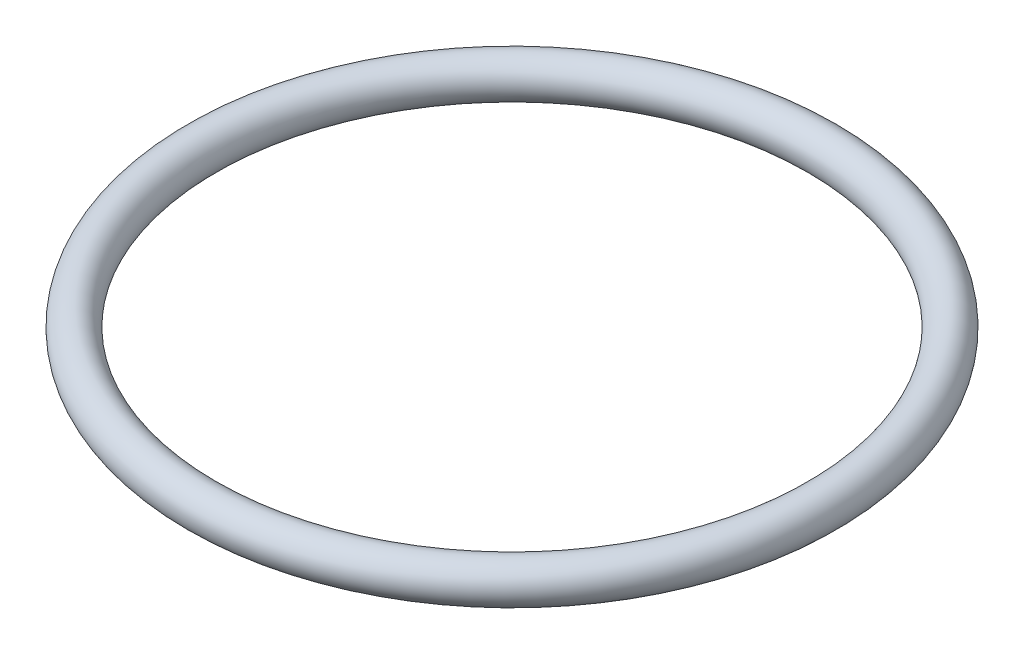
from build123d import *

# Parameters (mm, degrees)
ESQUISSE1_R = 0.75


with BuildPart() as part:
    # Esquisse1 → R_volution1 (revolve)
    with BuildSketch(Plane.XY, mode=Mode.PRIVATE) as r_volution1_sk:
        with Locations((-11.75, 21)):
            Circle(ESQUISSE1_R)
    revolve(r_volution1_sk.sketch.rotate(Axis((0, 29.958543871, 0), (0, -1, 0)), 270), axis=Axis((0, 29.958543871, 0), (0, -1, 0)))


solid = part.part
